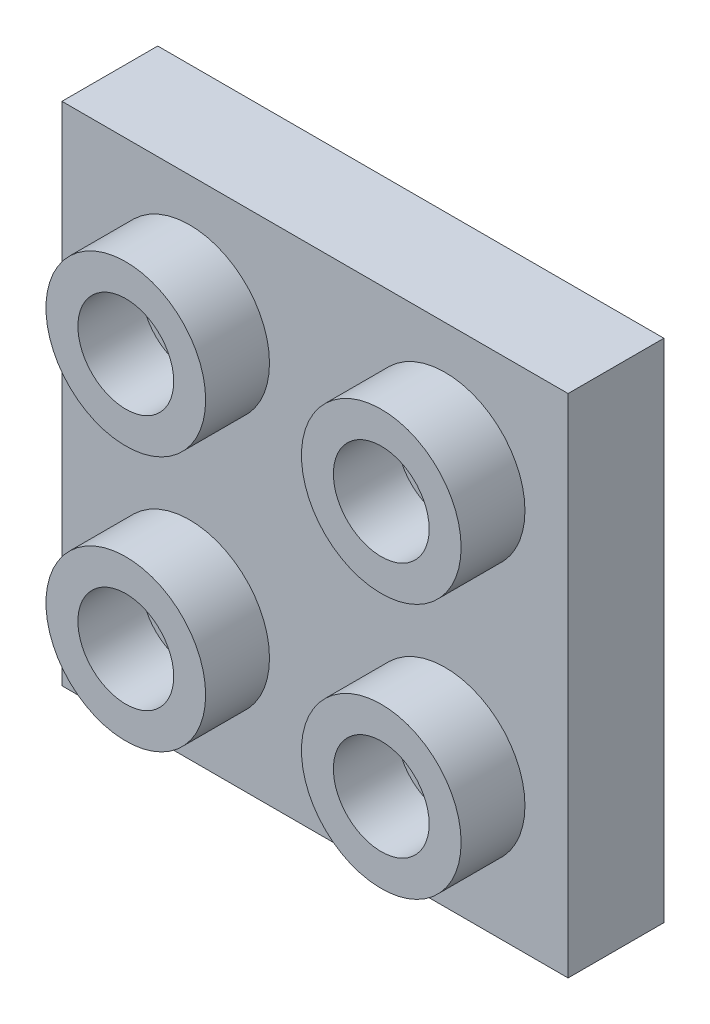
ISO-10303-21;
HEADER;
FILE_DESCRIPTION(('STEP AP214'),'2;1');
FILE_NAME('part.step','',(''),(''),'','','');
FILE_SCHEMA(('AUTOMOTIVE_DESIGN { 1 0 10303 214 1 1 1 1 }'));
ENDSEC;
DATA;
#1=APPLICATION_CONTEXT('core data for automotive mechanical design processes');
#2=APPLICATION_PROTOCOL_DEFINITION('international standard','automotive_design',2000,#1);
#3=PRODUCT_CONTEXT('',#1,'mechanical');
#4=PRODUCT('Part','Part','',(#3));
#5=PRODUCT_RELATED_PRODUCT_CATEGORY('part','',(#4));
#6=PRODUCT_DEFINITION_FORMATION('','',#4);
#7=PRODUCT_DEFINITION_CONTEXT('part definition',#1,'design');
#8=PRODUCT_DEFINITION('design','',#6,#7);
#9=PRODUCT_DEFINITION_SHAPE('','',#8);
#10=(LENGTH_UNIT() NAMED_UNIT(*) SI_UNIT(.MILLI.,.METRE.));
#11=(NAMED_UNIT(*) PLANE_ANGLE_UNIT() SI_UNIT($,.RADIAN.));
#12=(NAMED_UNIT(*) SI_UNIT($,.STERADIAN.) SOLID_ANGLE_UNIT());
#13=UNCERTAINTY_MEASURE_WITH_UNIT(LENGTH_MEASURE(1.E-05),#10,'distance_accuracy_value','');
#14=(GEOMETRIC_REPRESENTATION_CONTEXT(3) GLOBAL_UNCERTAINTY_ASSIGNED_CONTEXT((#13)) GLOBAL_UNIT_ASSIGNED_CONTEXT((#10,
#11,#12)) REPRESENTATION_CONTEXT('',''));
#15=CARTESIAN_POINT('',(0.,0.,0.));
#16=DIRECTION('',(0.,0.,1.));
#17=DIRECTION('',(1.,0.,0.));
#18=AXIS2_PLACEMENT_3D('',#15,#16,#17);
#19=CARTESIAN_POINT('',(-7.07760361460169,-6.48171549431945,-1.));
#20=DIRECTION('',(0.,-1.,0.));
#21=DIRECTION('',(1.,0.,0.));
#22=AXIS2_PLACEMENT_3D('',#19,#20,#21);
#23=PLANE('',#22);
#24=DIRECTION('',(-1.,0.,0.));
#25=VECTOR('',#24,1.);
#26=CARTESIAN_POINT('',(-7.07760361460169,-6.48171549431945,-1.));
#27=LINE('',#26,#25);
#28=CARTESIAN_POINT('',(-4.57760361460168,-6.48171549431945,-1.));
#29=VERTEX_POINT('',#28);
#30=CARTESIAN_POINT('',(-7.07760361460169,-6.48171549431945,-1.));
#31=VERTEX_POINT('',#30);
#32=EDGE_CURVE('E196',#29,#31,#27,.T.);
#33=ORIENTED_EDGE('',*,*,#32,.F.);
#34=DIRECTION('',(0.,0.,-1.));
#35=VECTOR('',#34,1.);
#36=CARTESIAN_POINT('',(-4.57760361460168,-6.48171549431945,-1.));
#37=LINE('',#36,#35);
#38=CARTESIAN_POINT('',(-4.57760361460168,-6.48171549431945,-3.));
#39=VERTEX_POINT('',#38);
#40=EDGE_CURVE('E180',#29,#39,#37,.T.);
#41=ORIENTED_EDGE('',*,*,#40,.T.);
#42=DIRECTION('',(-1.,0.,0.));
#43=VECTOR('',#42,1.);
#44=CARTESIAN_POINT('',(-7.07760361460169,-6.48171549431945,-3.));
#45=LINE('',#44,#43);
#46=CARTESIAN_POINT('',(-7.07760361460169,-6.48171549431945,-3.));
#47=VERTEX_POINT('',#46);
#48=EDGE_CURVE('E208',#39,#47,#45,.T.);
#49=ORIENTED_EDGE('',*,*,#48,.T.);
#50=DIRECTION('',(0.,0.,-1.));
#51=VECTOR('',#50,1.);
#52=CARTESIAN_POINT('',(-7.07760361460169,-6.48171549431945,-1.));
#53=LINE('',#52,#51);
#54=EDGE_CURVE('E211',#31,#47,#53,.T.);
#55=ORIENTED_EDGE('',*,*,#54,.F.);
#56=EDGE_LOOP('',(#33,#41,#49,#55));
#57=FACE_BOUND('',#56,.T.);
#58=ADVANCED_FACE('F39',(#57),#23,.F.);
#59=CARTESIAN_POINT('',(-8.57760361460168,-7.98171549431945,0.));
#60=DIRECTION('',(0.,0.,1.));
#61=DIRECTION('',(1.,0.,0.));
#62=AXIS2_PLACEMENT_3D('',#59,#60,#61);
#63=PLANE('',#62);
#64=CARTESIAN_POINT('',(-4.57760361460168,-3.98171549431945,0.));
#65=DIRECTION('',(0.,0.,1.));
#66=DIRECTION('',(1.,0.,0.));
#67=AXIS2_PLACEMENT_3D('',#64,#65,#66);
#68=CIRCLE('',#67,2.5);
#69=CARTESIAN_POINT('',(-2.07760361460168,-3.98171549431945,0.));
#70=VERTEX_POINT('',#69);
#71=EDGE_CURVE('E224',#70,#70,#68,.T.);
#72=ORIENTED_EDGE('',*,*,#71,.F.);
#73=EDGE_LOOP('',(#72));
#74=FACE_BOUND('',#73,.T.);
#75=DIRECTION('',(1.,0.,0.));
#76=VECTOR('',#75,1.);
#77=CARTESIAN_POINT('',(-8.57760361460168,-7.98171549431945,0.));
#78=LINE('',#77,#76);
#79=CARTESIAN_POINT('',(-8.57760361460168,-7.98171549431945,0.));
#80=VERTEX_POINT('',#79);
#81=CARTESIAN_POINT('',(7.27239638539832,-7.98171549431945,0.));
#82=VERTEX_POINT('',#81);
#83=EDGE_CURVE('E248',#80,#82,#78,.T.);
#84=ORIENTED_EDGE('',*,*,#83,.T.);
#85=DIRECTION('',(0.,1.,0.));
#86=VECTOR('',#85,1.);
#87=CARTESIAN_POINT('',(7.27239638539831,7.86828450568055,0.));
#88=LINE('',#87,#86);
#89=CARTESIAN_POINT('',(7.27239638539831,7.86828450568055,0.));
#90=VERTEX_POINT('',#89);
#91=EDGE_CURVE('E250',#82,#90,#88,.T.);
#92=ORIENTED_EDGE('',*,*,#91,.T.);
#93=DIRECTION('',(-1.,0.,0.));
#94=VECTOR('',#93,1.);
#95=CARTESIAN_POINT('',(-8.57760361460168,7.86828450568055,0.));
#96=LINE('',#95,#94);
#97=CARTESIAN_POINT('',(-8.57760361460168,7.86828450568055,0.));
#98=VERTEX_POINT('',#97);
#99=EDGE_CURVE('E235',#90,#98,#96,.T.);
#100=ORIENTED_EDGE('',*,*,#99,.T.);
#101=DIRECTION('',(0.,-1.,0.));
#102=VECTOR('',#101,1.);
#103=CARTESIAN_POINT('',(-8.57760361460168,7.86828450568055,0.));
#104=LINE('',#103,#102);
#105=EDGE_CURVE('E228',#98,#80,#104,.T.);
#106=ORIENTED_EDGE('',*,*,#105,.T.);
#107=EDGE_LOOP('',(#84,#92,#100,#106));
#108=FACE_BOUND('',#107,.T.);
#109=CARTESIAN_POINT('',(3.42239638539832,-3.98171549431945,0.));
#110=DIRECTION('',(0.,0.,1.));
#111=DIRECTION('',(1.,0.,0.));
#112=AXIS2_PLACEMENT_3D('',#109,#110,#111);
#113=CIRCLE('',#112,2.5);
#114=CARTESIAN_POINT('',(5.92239638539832,-3.98171549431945,0.));
#115=VERTEX_POINT('',#114);
#116=EDGE_CURVE('E213',#115,#115,#113,.T.);
#117=ORIENTED_EDGE('',*,*,#116,.F.);
#118=EDGE_LOOP('',(#117));
#119=FACE_BOUND('',#118,.T.);
#120=CARTESIAN_POINT('',(-4.57760361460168,4.01828450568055,0.));
#121=DIRECTION('',(0.,0.,1.));
#122=DIRECTION('',(1.,0.,0.));
#123=AXIS2_PLACEMENT_3D('',#120,#121,#122);
#124=CIRCLE('',#123,2.5);
#125=CARTESIAN_POINT('',(-2.07760361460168,4.01828450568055,0.));
#126=VERTEX_POINT('',#125);
#127=EDGE_CURVE('E257',#126,#126,#124,.T.);
#128=ORIENTED_EDGE('',*,*,#127,.F.);
#129=EDGE_LOOP('',(#128));
#130=FACE_BOUND('',#129,.T.);
#131=CARTESIAN_POINT('',(3.42239638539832,4.01828450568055,0.));
#132=DIRECTION('',(0.,0.,1.));
#133=DIRECTION('',(1.,0.,0.));
#134=AXIS2_PLACEMENT_3D('',#131,#132,#133);
#135=CIRCLE('',#134,2.5);
#136=CARTESIAN_POINT('',(5.92239638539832,4.01828450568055,0.));
#137=VERTEX_POINT('',#136);
#138=EDGE_CURVE('E269',#137,#137,#135,.T.);
#139=ORIENTED_EDGE('',*,*,#138,.F.);
#140=EDGE_LOOP('',(#139));
#141=FACE_BOUND('',#140,.T.);
#142=ADVANCED_FACE('F319',(#74,#108,#119,#130,#141),#63,.T.);
#143=CARTESIAN_POINT('',(-8.57760361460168,7.86828450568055,-3.));
#144=DIRECTION('',(-1.,0.,0.));
#145=DIRECTION('',(0.,0.,1.));
#146=AXIS2_PLACEMENT_3D('',#143,#144,#145);
#147=PLANE('',#146);
#148=ORIENTED_EDGE('',*,*,#105,.F.);
#149=DIRECTION('',(0.,0.,1.));
#150=VECTOR('',#149,1.);
#151=CARTESIAN_POINT('',(-8.57760361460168,7.86828450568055,-3.));
#152=LINE('',#151,#150);
#153=CARTESIAN_POINT('',(-8.57760361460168,7.86828450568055,-3.));
#154=VERTEX_POINT('',#153);
#155=EDGE_CURVE('E255',#154,#98,#152,.T.);
#156=ORIENTED_EDGE('',*,*,#155,.F.);
#157=DIRECTION('',(0.,-1.,0.));
#158=VECTOR('',#157,1.);
#159=CARTESIAN_POINT('',(-8.57760361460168,7.86828450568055,-3.));
#160=LINE('',#159,#158);
#161=CARTESIAN_POINT('',(-8.57760361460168,-7.98171549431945,-3.));
#162=VERTEX_POINT('',#161);
#163=EDGE_CURVE('E231',#154,#162,#160,.T.);
#164=ORIENTED_EDGE('',*,*,#163,.T.);
#165=DIRECTION('',(0.,0.,1.));
#166=VECTOR('',#165,1.);
#167=CARTESIAN_POINT('',(-8.57760361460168,-7.98171549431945,-3.));
#168=LINE('',#167,#166);
#169=EDGE_CURVE('E245',#162,#80,#168,.T.);
#170=ORIENTED_EDGE('',*,*,#169,.T.);
#171=EDGE_LOOP('',(#148,#156,#164,#170));
#172=FACE_BOUND('',#171,.T.);
#173=ADVANCED_FACE('F310',(#172),#147,.T.);
#174=CARTESIAN_POINT('',(-8.57760361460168,7.86828450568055,-3.));
#175=DIRECTION('',(0.,1.,0.));
#176=DIRECTION('',(0.,0.,1.));
#177=AXIS2_PLACEMENT_3D('',#174,#175,#176);
#178=PLANE('',#177);
#179=ORIENTED_EDGE('',*,*,#99,.F.);
#180=DIRECTION('',(0.,0.,1.));
#181=VECTOR('',#180,1.);
#182=CARTESIAN_POINT('',(7.27239638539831,7.86828450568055,-3.));
#183=LINE('',#182,#181);
#184=CARTESIAN_POINT('',(7.27239638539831,7.86828450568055,-3.));
#185=VERTEX_POINT('',#184);
#186=EDGE_CURVE('E258',#185,#90,#183,.T.);
#187=ORIENTED_EDGE('',*,*,#186,.F.);
#188=DIRECTION('',(-1.,0.,0.));
#189=VECTOR('',#188,1.);
#190=CARTESIAN_POINT('',(-8.57760361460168,7.86828450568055,-3.));
#191=LINE('',#190,#189);
#192=EDGE_CURVE('E242',#185,#154,#191,.T.);
#193=ORIENTED_EDGE('',*,*,#192,.T.);
#194=ORIENTED_EDGE('',*,*,#155,.T.);
#195=EDGE_LOOP('',(#179,#187,#193,#194));
#196=FACE_BOUND('',#195,.T.);
#197=ADVANCED_FACE('F314',(#196),#178,.T.);
#198=CARTESIAN_POINT('',(7.27239638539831,7.86828450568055,-3.));
#199=DIRECTION('',(1.,0.,0.));
#200=DIRECTION('',(0.,1.,0.));
#201=AXIS2_PLACEMENT_3D('',#198,#199,#200);
#202=PLANE('',#201);
#203=ORIENTED_EDGE('',*,*,#91,.F.);
#204=DIRECTION('',(0.,0.,1.));
#205=VECTOR('',#204,1.);
#206=CARTESIAN_POINT('',(7.27239638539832,-7.98171549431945,-3.));
#207=LINE('',#206,#205);
#208=CARTESIAN_POINT('',(7.27239638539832,-7.98171549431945,-3.));
#209=VERTEX_POINT('',#208);
#210=EDGE_CURVE('E260',#209,#82,#207,.T.);
#211=ORIENTED_EDGE('',*,*,#210,.F.);
#212=DIRECTION('',(0.,1.,0.));
#213=VECTOR('',#212,1.);
#214=CARTESIAN_POINT('',(7.27239638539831,7.86828450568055,-3.));
#215=LINE('',#214,#213);
#216=EDGE_CURVE('E239',#209,#185,#215,.T.);
#217=ORIENTED_EDGE('',*,*,#216,.T.);
#218=ORIENTED_EDGE('',*,*,#186,.T.);
#219=EDGE_LOOP('',(#203,#211,#217,#218));
#220=FACE_BOUND('',#219,.T.);
#221=ADVANCED_FACE('F317',(#220),#202,.T.);
#222=CARTESIAN_POINT('',(-8.57760361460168,-7.98171549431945,-3.));
#223=DIRECTION('',(0.,-1.,0.));
#224=DIRECTION('',(0.,0.,-1.));
#225=AXIS2_PLACEMENT_3D('',#222,#223,#224);
#226=PLANE('',#225);
#227=CARTESIAN_POINT('',(-0.577603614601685,-7.98171549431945,-3.5));
#228=DIRECTION('',(0.,-1.,0.));
#229=DIRECTION('',(0.,0.,-1.));
#230=AXIS2_PLACEMENT_3D('',#227,#228,#229);
#231=CIRCLE('',#230,3.);
#232=CARTESIAN_POINT('',(-0.577603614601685,-7.98171549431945,-6.5));
#233=VERTEX_POINT('',#232);
#234=EDGE_CURVE('E788',#233,#233,#231,.T.);
#235=ORIENTED_EDGE('',*,*,#234,.F.);
#236=EDGE_LOOP('',(#235));
#237=FACE_BOUND('',#236,.T.);
#238=ORIENTED_EDGE('',*,*,#210,.T.);
#239=ORIENTED_EDGE('',*,*,#83,.F.);
#240=ORIENTED_EDGE('',*,*,#169,.F.);
#241=DIRECTION('',(1.,0.,0.));
#242=VECTOR('',#241,1.);
#243=CARTESIAN_POINT('',(-8.57760361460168,-7.98171549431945,-3.));
#244=LINE('',#243,#242);
#245=CARTESIAN_POINT('',(-4.57760361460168,-7.98171549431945,-3.));
#246=VERTEX_POINT('',#245);
#247=EDGE_CURVE('E236',#162,#246,#244,.T.);
#248=ORIENTED_EDGE('',*,*,#247,.T.);
#249=DIRECTION('',(0.,0.,-1.));
#250=VECTOR('',#249,1.);
#251=CARTESIAN_POINT('',(-4.57760361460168,-7.98171549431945,-3.5));
#252=LINE('',#251,#250);
#253=CARTESIAN_POINT('',(-4.57760361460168,-7.98171549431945,-3.5));
#254=VERTEX_POINT('',#253);
#255=EDGE_CURVE('E161',#246,#254,#252,.T.);
#256=ORIENTED_EDGE('',*,*,#255,.T.);
#257=CARTESIAN_POINT('',(-0.577603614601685,-7.98171549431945,-3.5));
#258=DIRECTION('',(0.,-1.,0.));
#259=DIRECTION('',(0.,0.,-1.));
#260=AXIS2_PLACEMENT_3D('',#257,#258,#259);
#261=CIRCLE('',#260,4.);
#262=CARTESIAN_POINT('',(3.42239638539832,-7.98171549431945,-3.5));
#263=VERTEX_POINT('',#262);
#264=EDGE_CURVE('E169',#254,#263,#261,.T.);
#265=ORIENTED_EDGE('',*,*,#264,.T.);
#266=DIRECTION('',(0.,0.,1.));
#267=VECTOR('',#266,1.);
#268=CARTESIAN_POINT('',(3.42239638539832,-7.98171549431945,-3.5));
#269=LINE('',#268,#267);
#270=CARTESIAN_POINT('',(3.42239638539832,-7.98171549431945,-3.));
#271=VERTEX_POINT('',#270);
#272=EDGE_CURVE('E146',#263,#271,#269,.T.);
#273=ORIENTED_EDGE('',*,*,#272,.T.);
#274=EDGE_CURVE('E234',#271,#209,#244,.T.);
#275=ORIENTED_EDGE('',*,*,#274,.T.);
#276=EDGE_LOOP('',(#238,#239,#240,#248,#256,#265,#273,#275));
#277=FACE_BOUND('',#276,.T.);
#278=ADVANCED_FACE('F294',(#237,#277),#226,.T.);
#279=CARTESIAN_POINT('',(-8.57760361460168,-7.98171549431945,-3.));
#280=DIRECTION('',(0.,0.,1.));
#281=DIRECTION('',(1.,0.,0.));
#282=AXIS2_PLACEMENT_3D('',#279,#280,#281);
#283=PLANE('',#282);
#284=ORIENTED_EDGE('',*,*,#48,.F.);
#285=DIRECTION('',(0.,-1.,0.));
#286=VECTOR('',#285,1.);
#287=CARTESIAN_POINT('',(-4.57760361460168,-7.98171549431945,-3.));
#288=LINE('',#287,#286);
#289=EDGE_CURVE('E183',#39,#246,#288,.T.);
#290=ORIENTED_EDGE('',*,*,#289,.T.);
#291=ORIENTED_EDGE('',*,*,#247,.F.);
#292=ORIENTED_EDGE('',*,*,#163,.F.);
#293=ORIENTED_EDGE('',*,*,#192,.F.);
#294=ORIENTED_EDGE('',*,*,#216,.F.);
#295=ORIENTED_EDGE('',*,*,#274,.F.);
#296=DIRECTION('',(0.,1.,0.));
#297=VECTOR('',#296,1.);
#298=CARTESIAN_POINT('',(3.42239638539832,-7.98171549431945,-3.));
#299=LINE('',#298,#297);
#300=CARTESIAN_POINT('',(3.42239638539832,-6.48171549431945,-3.));
#301=VERTEX_POINT('',#300);
#302=EDGE_CURVE('E177',#271,#301,#299,.T.);
#303=ORIENTED_EDGE('',*,*,#302,.T.);
#304=CARTESIAN_POINT('',(5.77239638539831,-6.48171549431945,-3.));
#305=VERTEX_POINT('',#304);
#306=EDGE_CURVE('E190',#305,#301,#45,.T.);
#307=ORIENTED_EDGE('',*,*,#306,.F.);
#308=DIRECTION('',(0.,-1.,0.));
#309=VECTOR('',#308,1.);
#310=CARTESIAN_POINT('',(5.77239638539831,-6.48171549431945,-3.));
#311=LINE('',#310,#309);
#312=CARTESIAN_POINT('',(5.77239638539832,6.36828450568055,-3.));
#313=VERTEX_POINT('',#312);
#314=EDGE_CURVE('E205',#313,#305,#311,.T.);
#315=ORIENTED_EDGE('',*,*,#314,.F.);
#316=DIRECTION('',(1.,0.,0.));
#317=VECTOR('',#316,1.);
#318=CARTESIAN_POINT('',(-7.07760361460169,6.36828450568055,-3.));
#319=LINE('',#318,#317);
#320=CARTESIAN_POINT('',(-7.07760361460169,6.36828450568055,-3.));
#321=VERTEX_POINT('',#320);
#322=EDGE_CURVE('E202',#321,#313,#319,.T.);
#323=ORIENTED_EDGE('',*,*,#322,.F.);
#324=DIRECTION('',(0.,1.,0.));
#325=VECTOR('',#324,1.);
#326=CARTESIAN_POINT('',(-7.07760361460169,-6.48171549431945,-3.));
#327=LINE('',#326,#325);
#328=EDGE_CURVE('E61',#47,#321,#327,.T.);
#329=ORIENTED_EDGE('',*,*,#328,.F.);
#330=EDGE_LOOP('',(#284,#290,#291,#292,#293,#294,#295,#303,#307,#315,#323,#329));
#331=FACE_BOUND('',#330,.T.);
#332=ADVANCED_FACE('F290',(#331),#283,.F.);
#333=CARTESIAN_POINT('',(-4.57760361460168,-3.98171549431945,2.));
#334=DIRECTION('',(0.,0.,-1.));
#335=DIRECTION('',(-1.,0.,0.));
#336=AXIS2_PLACEMENT_3D('',#333,#334,#335);
#337=CYLINDRICAL_SURFACE('',#336,2.5);
#338=CARTESIAN_POINT('',(-4.57760361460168,-3.98171549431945,2.));
#339=DIRECTION('',(0.,0.,1.));
#340=DIRECTION('',(1.,0.,0.));
#341=AXIS2_PLACEMENT_3D('',#338,#339,#340);
#342=CIRCLE('',#341,2.5);
#343=CARTESIAN_POINT('',(-2.07760361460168,-3.98171549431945,2.));
#344=VERTEX_POINT('',#343);
#345=EDGE_CURVE('E225',#344,#344,#342,.T.);
#346=ORIENTED_EDGE('',*,*,#345,.F.);
#347=EDGE_LOOP('',(#346));
#348=FACE_BOUND('',#347,.T.);
#349=ORIENTED_EDGE('',*,*,#71,.T.);
#350=EDGE_LOOP('',(#349));
#351=FACE_BOUND('',#350,.T.);
#352=ADVANCED_FACE('F369',(#348,#351),#337,.T.);
#353=CARTESIAN_POINT('',(-4.57760361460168,-3.98171549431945,2.));
#354=DIRECTION('',(0.,0.,1.));
#355=DIRECTION('',(1.,0.,0.));
#356=AXIS2_PLACEMENT_3D('',#353,#354,#355);
#357=PLANE('',#356);
#358=CARTESIAN_POINT('',(-4.57760361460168,-3.98171549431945,2.));
#359=DIRECTION('',(0.,0.,1.));
#360=DIRECTION('',(1.,0.,0.));
#361=AXIS2_PLACEMENT_3D('',#358,#359,#360);
#362=CIRCLE('',#361,1.5);
#363=CARTESIAN_POINT('',(-3.07760361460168,-3.98171549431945,2.));
#364=VERTEX_POINT('',#363);
#365=EDGE_CURVE('E165',#364,#364,#362,.T.);
#366=ORIENTED_EDGE('',*,*,#365,.F.);
#367=EDGE_LOOP('',(#366));
#368=FACE_BOUND('',#367,.T.);
#369=ORIENTED_EDGE('',*,*,#345,.T.);
#370=EDGE_LOOP('',(#369));
#371=FACE_BOUND('',#370,.T.);
#372=ADVANCED_FACE('F363',(#368,#371),#357,.T.);
#373=CARTESIAN_POINT('',(3.42239638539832,-3.98171549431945,2.));
#374=DIRECTION('',(0.,0.,-1.));
#375=DIRECTION('',(-1.,0.,0.));
#376=AXIS2_PLACEMENT_3D('',#373,#374,#375);
#377=CYLINDRICAL_SURFACE('',#376,2.5);
#378=CARTESIAN_POINT('',(3.42239638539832,-3.98171549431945,2.));
#379=DIRECTION('',(0.,0.,1.));
#380=DIRECTION('',(1.,0.,0.));
#381=AXIS2_PLACEMENT_3D('',#378,#379,#380);
#382=CIRCLE('',#381,2.5);
#383=CARTESIAN_POINT('',(5.92239638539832,-3.98171549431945,2.));
#384=VERTEX_POINT('',#383);
#385=EDGE_CURVE('E221',#384,#384,#382,.T.);
#386=ORIENTED_EDGE('',*,*,#385,.F.);
#387=EDGE_LOOP('',(#386));
#388=FACE_BOUND('',#387,.T.);
#389=ORIENTED_EDGE('',*,*,#116,.T.);
#390=EDGE_LOOP('',(#389));
#391=FACE_BOUND('',#390,.T.);
#392=ADVANCED_FACE('F361',(#388,#391),#377,.T.);
#393=CARTESIAN_POINT('',(3.42239638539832,-3.98171549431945,2.));
#394=DIRECTION('',(0.,0.,1.));
#395=DIRECTION('',(1.,0.,0.));
#396=AXIS2_PLACEMENT_3D('',#393,#394,#395);
#397=PLANE('',#396);
#398=CARTESIAN_POINT('',(3.42239638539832,-3.98171549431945,2.));
#399=DIRECTION('',(0.,0.,1.));
#400=DIRECTION('',(1.,0.,0.));
#401=AXIS2_PLACEMENT_3D('',#398,#399,#400);
#402=CIRCLE('',#401,1.5);
#403=CARTESIAN_POINT('',(4.92239638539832,-3.98171549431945,2.));
#404=VERTEX_POINT('',#403);
#405=EDGE_CURVE('E402',#404,#404,#402,.T.);
#406=ORIENTED_EDGE('',*,*,#405,.F.);
#407=EDGE_LOOP('',(#406));
#408=FACE_BOUND('',#407,.T.);
#409=ORIENTED_EDGE('',*,*,#385,.T.);
#410=EDGE_LOOP('',(#409));
#411=FACE_BOUND('',#410,.T.);
#412=ADVANCED_FACE('F357',(#408,#411),#397,.T.);
#413=CARTESIAN_POINT('',(-4.57760361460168,4.01828450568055,2.));
#414=DIRECTION('',(0.,0.,1.));
#415=DIRECTION('',(1.,0.,0.));
#416=AXIS2_PLACEMENT_3D('',#413,#414,#415);
#417=PLANE('',#416);
#418=CARTESIAN_POINT('',(-4.57760361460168,4.01828450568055,2.));
#419=DIRECTION('',(0.,0.,1.));
#420=DIRECTION('',(1.,0.,0.));
#421=AXIS2_PLACEMENT_3D('',#418,#419,#420);
#422=CIRCLE('',#421,1.5);
#423=CARTESIAN_POINT('',(-3.07760361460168,4.01828450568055,2.));
#424=VERTEX_POINT('',#423);
#425=EDGE_CURVE('E394',#424,#424,#422,.T.);
#426=ORIENTED_EDGE('',*,*,#425,.F.);
#427=EDGE_LOOP('',(#426));
#428=FACE_BOUND('',#427,.T.);
#429=CARTESIAN_POINT('',(-4.57760361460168,4.01828450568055,2.));
#430=DIRECTION('',(0.,0.,1.));
#431=DIRECTION('',(1.,0.,0.));
#432=AXIS2_PLACEMENT_3D('',#429,#430,#431);
#433=CIRCLE('',#432,2.5);
#434=CARTESIAN_POINT('',(-2.07760361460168,4.01828450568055,2.));
#435=VERTEX_POINT('',#434);
#436=EDGE_CURVE('E266',#435,#435,#433,.T.);
#437=ORIENTED_EDGE('',*,*,#436,.T.);
#438=EDGE_LOOP('',(#437));
#439=FACE_BOUND('',#438,.T.);
#440=ADVANCED_FACE('F360',(#428,#439),#417,.T.);
#441=CARTESIAN_POINT('',(-4.57760361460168,4.01828450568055,2.));
#442=DIRECTION('',(0.,0.,-1.));
#443=DIRECTION('',(-1.,0.,0.));
#444=AXIS2_PLACEMENT_3D('',#441,#442,#443);
#445=CYLINDRICAL_SURFACE('',#444,2.5);
#446=ORIENTED_EDGE('',*,*,#436,.F.);
#447=EDGE_LOOP('',(#446));
#448=FACE_BOUND('',#447,.T.);
#449=ORIENTED_EDGE('',*,*,#127,.T.);
#450=EDGE_LOOP('',(#449));
#451=FACE_BOUND('',#450,.T.);
#452=ADVANCED_FACE('F338',(#448,#451),#445,.T.);
#453=CARTESIAN_POINT('',(3.42239638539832,4.01828450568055,2.));
#454=DIRECTION('',(0.,0.,1.));
#455=DIRECTION('',(1.,0.,0.));
#456=AXIS2_PLACEMENT_3D('',#453,#454,#455);
#457=PLANE('',#456);
#458=CARTESIAN_POINT('',(3.42239638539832,4.01828450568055,2.));
#459=DIRECTION('',(0.,0.,1.));
#460=DIRECTION('',(1.,0.,0.));
#461=AXIS2_PLACEMENT_3D('',#458,#459,#460);
#462=CIRCLE('',#461,1.5);
#463=CARTESIAN_POINT('',(4.92239638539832,4.01828450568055,2.));
#464=VERTEX_POINT('',#463);
#465=EDGE_CURVE('E405',#464,#464,#462,.T.);
#466=ORIENTED_EDGE('',*,*,#465,.F.);
#467=EDGE_LOOP('',(#466));
#468=FACE_BOUND('',#467,.T.);
#469=CARTESIAN_POINT('',(3.42239638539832,4.01828450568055,2.));
#470=DIRECTION('',(0.,0.,1.));
#471=DIRECTION('',(1.,0.,0.));
#472=AXIS2_PLACEMENT_3D('',#469,#470,#471);
#473=CIRCLE('',#472,2.5);
#474=CARTESIAN_POINT('',(5.92239638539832,4.01828450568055,2.));
#475=VERTEX_POINT('',#474);
#476=EDGE_CURVE('E272',#475,#475,#473,.T.);
#477=ORIENTED_EDGE('',*,*,#476,.T.);
#478=EDGE_LOOP('',(#477));
#479=FACE_BOUND('',#478,.T.);
#480=ADVANCED_FACE('F41',(#468,#479),#457,.T.);
#481=CARTESIAN_POINT('',(3.42239638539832,4.01828450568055,2.));
#482=DIRECTION('',(0.,0.,-1.));
#483=DIRECTION('',(-1.,0.,0.));
#484=AXIS2_PLACEMENT_3D('',#481,#482,#483);
#485=CYLINDRICAL_SURFACE('',#484,2.5);
#486=ORIENTED_EDGE('',*,*,#476,.F.);
#487=EDGE_LOOP('',(#486));
#488=FACE_BOUND('',#487,.T.);
#489=ORIENTED_EDGE('',*,*,#138,.T.);
#490=EDGE_LOOP('',(#489));
#491=FACE_BOUND('',#490,.T.);
#492=ADVANCED_FACE('F330',(#488,#491),#485,.T.);
#493=CARTESIAN_POINT('',(-7.07760361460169,-6.48171549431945,-1.));
#494=DIRECTION('',(-1.,0.,0.));
#495=DIRECTION('',(0.,0.,1.));
#496=AXIS2_PLACEMENT_3D('',#493,#494,#495);
#497=PLANE('',#496);
#498=ORIENTED_EDGE('',*,*,#328,.T.);
#499=DIRECTION('',(0.,0.,-1.));
#500=VECTOR('',#499,1.);
#501=CARTESIAN_POINT('',(-7.07760361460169,6.36828450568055,-1.));
#502=LINE('',#501,#500);
#503=CARTESIAN_POINT('',(-7.07760361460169,6.36828450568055,-1.));
#504=VERTEX_POINT('',#503);
#505=EDGE_CURVE('E200',#504,#321,#502,.T.);
#506=ORIENTED_EDGE('',*,*,#505,.F.);
#507=DIRECTION('',(0.,1.,0.));
#508=VECTOR('',#507,1.);
#509=CARTESIAN_POINT('',(-7.07760361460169,-6.48171549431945,-1.));
#510=LINE('',#509,#508);
#511=EDGE_CURVE('E186',#31,#504,#510,.T.);
#512=ORIENTED_EDGE('',*,*,#511,.F.);
#513=ORIENTED_EDGE('',*,*,#54,.T.);
#514=EDGE_LOOP('',(#498,#506,#512,#513));
#515=FACE_BOUND('',#514,.T.);
#516=ADVANCED_FACE('F303',(#515),#497,.F.);
#517=ORIENTED_EDGE('',*,*,#306,.T.);
#518=DIRECTION('',(0.,0.,1.));
#519=VECTOR('',#518,1.);
#520=CARTESIAN_POINT('',(3.42239638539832,-6.48171549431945,-1.));
#521=LINE('',#520,#519);
#522=CARTESIAN_POINT('',(3.42239638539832,-6.48171549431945,-1.));
#523=VERTEX_POINT('',#522);
#524=EDGE_CURVE('E173',#301,#523,#521,.T.);
#525=ORIENTED_EDGE('',*,*,#524,.T.);
#526=CARTESIAN_POINT('',(5.77239638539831,-6.48171549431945,-1.));
#527=VERTEX_POINT('',#526);
#528=EDGE_CURVE('E197',#527,#523,#27,.T.);
#529=ORIENTED_EDGE('',*,*,#528,.F.);
#530=DIRECTION('',(0.,0.,-1.));
#531=VECTOR('',#530,1.);
#532=CARTESIAN_POINT('',(5.77239638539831,-6.48171549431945,-1.));
#533=LINE('',#532,#531);
#534=EDGE_CURVE('E214',#527,#305,#533,.T.);
#535=ORIENTED_EDGE('',*,*,#534,.T.);
#536=EDGE_LOOP('',(#517,#525,#529,#535));
#537=FACE_BOUND('',#536,.T.);
#538=ADVANCED_FACE('F278',(#537),#23,.F.);
#539=CARTESIAN_POINT('',(5.77239638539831,-6.48171549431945,-1.));
#540=DIRECTION('',(1.,0.,0.));
#541=DIRECTION('',(0.,1.,0.));
#542=AXIS2_PLACEMENT_3D('',#539,#540,#541);
#543=PLANE('',#542);
#544=ORIENTED_EDGE('',*,*,#314,.T.);
#545=ORIENTED_EDGE('',*,*,#534,.F.);
#546=DIRECTION('',(0.,-1.,0.));
#547=VECTOR('',#546,1.);
#548=CARTESIAN_POINT('',(5.77239638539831,-6.48171549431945,-1.));
#549=LINE('',#548,#547);
#550=CARTESIAN_POINT('',(5.77239638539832,6.36828450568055,-1.));
#551=VERTEX_POINT('',#550);
#552=EDGE_CURVE('E193',#551,#527,#549,.T.);
#553=ORIENTED_EDGE('',*,*,#552,.F.);
#554=DIRECTION('',(0.,0.,-1.));
#555=VECTOR('',#554,1.);
#556=CARTESIAN_POINT('',(5.77239638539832,6.36828450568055,-1.));
#557=LINE('',#556,#555);
#558=EDGE_CURVE('E216',#551,#313,#557,.T.);
#559=ORIENTED_EDGE('',*,*,#558,.T.);
#560=EDGE_LOOP('',(#544,#545,#553,#559));
#561=FACE_BOUND('',#560,.T.);
#562=ADVANCED_FACE('F285',(#561),#543,.F.);
#563=CARTESIAN_POINT('',(-7.07760361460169,6.36828450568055,-1.));
#564=DIRECTION('',(0.,1.,0.));
#565=DIRECTION('',(-1.,0.,0.));
#566=AXIS2_PLACEMENT_3D('',#563,#564,#565);
#567=PLANE('',#566);
#568=ORIENTED_EDGE('',*,*,#322,.T.);
#569=ORIENTED_EDGE('',*,*,#558,.F.);
#570=DIRECTION('',(1.,0.,0.));
#571=VECTOR('',#570,1.);
#572=CARTESIAN_POINT('',(-7.07760361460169,6.36828450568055,-1.));
#573=LINE('',#572,#571);
#574=EDGE_CURVE('E189',#504,#551,#573,.T.);
#575=ORIENTED_EDGE('',*,*,#574,.F.);
#576=ORIENTED_EDGE('',*,*,#505,.T.);
#577=EDGE_LOOP('',(#568,#569,#575,#576));
#578=FACE_BOUND('',#577,.T.);
#579=ADVANCED_FACE('F305',(#578),#567,.F.);
#580=CARTESIAN_POINT('',(-7.07760361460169,6.36828450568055,-1.));
#581=DIRECTION('',(0.,0.,-1.));
#582=DIRECTION('',(-1.,0.,0.));
#583=AXIS2_PLACEMENT_3D('',#580,#581,#582);
#584=PLANE('',#583);
#585=DIRECTION('',(0.,1.,0.));
#586=VECTOR('',#585,1.);
#587=CARTESIAN_POINT('',(-4.57760361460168,6.36828450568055,-1.));
#588=LINE('',#587,#586);
#589=CARTESIAN_POINT('',(-4.57760361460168,-0.98171549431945,-1.));
#590=VERTEX_POINT('',#589);
#591=EDGE_CURVE('E11',#29,#590,#588,.T.);
#592=ORIENTED_EDGE('',*,*,#591,.F.);
#593=ORIENTED_EDGE('',*,*,#32,.T.);
#594=ORIENTED_EDGE('',*,*,#511,.T.);
#595=ORIENTED_EDGE('',*,*,#574,.T.);
#596=ORIENTED_EDGE('',*,*,#552,.T.);
#597=ORIENTED_EDGE('',*,*,#528,.T.);
#598=DIRECTION('',(0.,-1.,0.));
#599=VECTOR('',#598,1.);
#600=CARTESIAN_POINT('',(3.42239638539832,6.36828450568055,-1.));
#601=LINE('',#600,#599);
#602=CARTESIAN_POINT('',(3.42239638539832,-0.98171549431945,-1.));
#603=VERTEX_POINT('',#602);
#604=EDGE_CURVE('E47',#603,#523,#601,.T.);
#605=ORIENTED_EDGE('',*,*,#604,.F.);
#606=DIRECTION('',(-1.,0.,0.));
#607=VECTOR('',#606,1.);
#608=CARTESIAN_POINT('',(-7.07760361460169,-0.98171549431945,-1.));
#609=LINE('',#608,#607);
#610=EDGE_CURVE('E156',#603,#590,#609,.T.);
#611=ORIENTED_EDGE('',*,*,#610,.T.);
#612=EDGE_LOOP('',(#592,#593,#594,#595,#596,#597,#605,#611));
#613=FACE_BOUND('',#612,.T.);
#614=ADVANCED_FACE('F281',(#613),#584,.T.);
#615=CARTESIAN_POINT('',(-4.57760361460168,-0.98171549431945,-3.5));
#616=DIRECTION('',(-1.,0.,0.));
#617=DIRECTION('',(0.,0.,1.));
#618=AXIS2_PLACEMENT_3D('',#615,#616,#617);
#619=PLANE('',#618);
#620=ORIENTED_EDGE('',*,*,#289,.F.);
#621=ORIENTED_EDGE('',*,*,#40,.F.);
#622=ORIENTED_EDGE('',*,*,#591,.T.);
#623=DIRECTION('',(0.,0.,-1.));
#624=VECTOR('',#623,1.);
#625=CARTESIAN_POINT('',(-4.57760361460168,-0.98171549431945,-3.5));
#626=LINE('',#625,#624);
#627=CARTESIAN_POINT('',(-4.57760361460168,-0.98171549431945,-3.5));
#628=VERTEX_POINT('',#627);
#629=EDGE_CURVE('E54',#590,#628,#626,.T.);
#630=ORIENTED_EDGE('',*,*,#629,.T.);
#631=DIRECTION('',(0.,-1.,0.));
#632=VECTOR('',#631,1.);
#633=CARTESIAN_POINT('',(-4.57760361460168,-0.98171549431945,-3.5));
#634=LINE('',#633,#632);
#635=EDGE_CURVE('E151',#628,#254,#634,.T.);
#636=ORIENTED_EDGE('',*,*,#635,.T.);
#637=ORIENTED_EDGE('',*,*,#255,.F.);
#638=EDGE_LOOP('',(#620,#621,#622,#630,#636,#637));
#639=FACE_BOUND('',#638,.T.);
#640=ADVANCED_FACE('F298',(#639),#619,.T.);
#641=CARTESIAN_POINT('',(3.42239638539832,-0.98171549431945,-3.5));
#642=DIRECTION('',(1.,0.,0.));
#643=DIRECTION('',(0.,0.,-1.));
#644=AXIS2_PLACEMENT_3D('',#641,#642,#643);
#645=PLANE('',#644);
#646=ORIENTED_EDGE('',*,*,#302,.F.);
#647=ORIENTED_EDGE('',*,*,#272,.F.);
#648=DIRECTION('',(0.,-1.,0.));
#649=VECTOR('',#648,1.);
#650=CARTESIAN_POINT('',(3.42239638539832,-0.98171549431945,-3.5));
#651=LINE('',#650,#649);
#652=CARTESIAN_POINT('',(3.42239638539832,-0.98171549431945,-3.5));
#653=VERTEX_POINT('',#652);
#654=EDGE_CURVE('E140',#653,#263,#651,.T.);
#655=ORIENTED_EDGE('',*,*,#654,.F.);
#656=DIRECTION('',(0.,0.,1.));
#657=VECTOR('',#656,1.);
#658=CARTESIAN_POINT('',(3.42239638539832,-0.98171549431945,-3.5));
#659=LINE('',#658,#657);
#660=EDGE_CURVE('E143',#653,#603,#659,.T.);
#661=ORIENTED_EDGE('',*,*,#660,.T.);
#662=ORIENTED_EDGE('',*,*,#604,.T.);
#663=ORIENTED_EDGE('',*,*,#524,.F.);
#664=EDGE_LOOP('',(#646,#647,#655,#661,#662,#663));
#665=FACE_BOUND('',#664,.T.);
#666=ADVANCED_FACE('F142',(#665),#645,.T.);
#667=CARTESIAN_POINT('',(-0.577603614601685,-0.98171549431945,-3.5));
#668=DIRECTION('',(0.,-1.,0.));
#669=DIRECTION('',(0.,0.,-1.));
#670=AXIS2_PLACEMENT_3D('',#667,#668,#669);
#671=CYLINDRICAL_SURFACE('',#670,4.);
#672=ORIENTED_EDGE('',*,*,#264,.F.);
#673=ORIENTED_EDGE('',*,*,#635,.F.);
#674=CARTESIAN_POINT('',(-0.577603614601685,-0.98171549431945,-3.5));
#675=DIRECTION('',(0.,-1.,0.));
#676=DIRECTION('',(0.,0.,-1.));
#677=AXIS2_PLACEMENT_3D('',#674,#675,#676);
#678=CIRCLE('',#677,4.);
#679=EDGE_CURVE('E154',#628,#653,#678,.T.);
#680=ORIENTED_EDGE('',*,*,#679,.T.);
#681=ORIENTED_EDGE('',*,*,#654,.T.);
#682=EDGE_LOOP('',(#672,#673,#680,#681));
#683=FACE_BOUND('',#682,.T.);
#684=ADVANCED_FACE('F159',(#683),#671,.T.);
#685=CARTESIAN_POINT('',(-0.577603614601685,-0.98171549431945,-3.5));
#686=DIRECTION('',(0.,-1.,0.));
#687=DIRECTION('',(0.,0.,-1.));
#688=AXIS2_PLACEMENT_3D('',#685,#686,#687);
#689=PLANE('',#688);
#690=CARTESIAN_POINT('',(-0.577603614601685,-0.98171549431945,-3.5));
#691=DIRECTION('',(0.,-1.,0.));
#692=DIRECTION('',(0.,0.,-1.));
#693=AXIS2_PLACEMENT_3D('',#690,#691,#692);
#694=CIRCLE('',#693,2.4);
#695=CARTESIAN_POINT('',(-0.577603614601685,-0.98171549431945,-5.9));
#696=VERTEX_POINT('',#695);
#697=EDGE_CURVE('E787',#696,#696,#694,.T.);
#698=ORIENTED_EDGE('',*,*,#697,.T.);
#699=EDGE_LOOP('',(#698));
#700=FACE_BOUND('',#699,.T.);
#701=ORIENTED_EDGE('',*,*,#610,.F.);
#702=ORIENTED_EDGE('',*,*,#660,.F.);
#703=ORIENTED_EDGE('',*,*,#679,.F.);
#704=ORIENTED_EDGE('',*,*,#629,.F.);
#705=EDGE_LOOP('',(#701,#702,#703,#704));
#706=FACE_BOUND('',#705,.T.);
#707=ADVANCED_FACE('F153',(#700,#706),#689,.F.);
#708=CARTESIAN_POINT('',(-4.57760361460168,-3.98171549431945,0.));
#709=DIRECTION('',(0.,0.,1.));
#710=DIRECTION('',(1.,0.,0.));
#711=AXIS2_PLACEMENT_3D('',#708,#709,#710);
#712=CYLINDRICAL_SURFACE('',#711,1.5);
#713=CARTESIAN_POINT('',(-4.57760361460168,-3.98171549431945,0.));
#714=DIRECTION('',(0.,0.,1.));
#715=DIRECTION('',(1.,0.,0.));
#716=AXIS2_PLACEMENT_3D('',#713,#714,#715);
#717=CIRCLE('',#716,1.5);
#718=CARTESIAN_POINT('',(-3.07760361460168,-3.98171549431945,0.));
#719=VERTEX_POINT('',#718);
#720=EDGE_CURVE('E171',#719,#719,#717,.T.);
#721=ORIENTED_EDGE('',*,*,#720,.F.);
#722=EDGE_LOOP('',(#721));
#723=FACE_BOUND('',#722,.T.);
#724=ORIENTED_EDGE('',*,*,#365,.T.);
#725=EDGE_LOOP('',(#724));
#726=FACE_BOUND('',#725,.T.);
#727=ADVANCED_FACE('F419',(#723,#726),#712,.F.);
#728=CARTESIAN_POINT('',(-4.57760361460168,-3.98171549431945,0.));
#729=DIRECTION('',(0.,0.,1.));
#730=DIRECTION('',(1.,0.,0.));
#731=AXIS2_PLACEMENT_3D('',#728,#729,#730);
#732=PLANE('',#731);
#733=ORIENTED_EDGE('',*,*,#720,.T.);
#734=EDGE_LOOP('',(#733));
#735=FACE_BOUND('',#734,.T.);
#736=ADVANCED_FACE('F425',(#735),#732,.T.);
#737=CARTESIAN_POINT('',(3.42239638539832,-3.98171549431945,0.));
#738=DIRECTION('',(0.,0.,1.));
#739=DIRECTION('',(1.,0.,0.));
#740=AXIS2_PLACEMENT_3D('',#737,#738,#739);
#741=CYLINDRICAL_SURFACE('',#740,1.5);
#742=CARTESIAN_POINT('',(3.42239638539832,-3.98171549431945,0.));
#743=DIRECTION('',(0.,0.,1.));
#744=DIRECTION('',(1.,0.,0.));
#745=AXIS2_PLACEMENT_3D('',#742,#743,#744);
#746=CIRCLE('',#745,1.5);
#747=CARTESIAN_POINT('',(4.92239638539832,-3.98171549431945,0.));
#748=VERTEX_POINT('',#747);
#749=EDGE_CURVE('E409',#748,#748,#746,.T.);
#750=ORIENTED_EDGE('',*,*,#749,.F.);
#751=EDGE_LOOP('',(#750));
#752=FACE_BOUND('',#751,.T.);
#753=ORIENTED_EDGE('',*,*,#405,.T.);
#754=EDGE_LOOP('',(#753));
#755=FACE_BOUND('',#754,.T.);
#756=ADVANCED_FACE('F432',(#752,#755),#741,.F.);
#757=CARTESIAN_POINT('',(3.42239638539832,-3.98171549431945,0.));
#758=DIRECTION('',(0.,0.,1.));
#759=DIRECTION('',(1.,0.,0.));
#760=AXIS2_PLACEMENT_3D('',#757,#758,#759);
#761=PLANE('',#760);
#762=ORIENTED_EDGE('',*,*,#749,.T.);
#763=EDGE_LOOP('',(#762));
#764=FACE_BOUND('',#763,.T.);
#765=ADVANCED_FACE('F473',(#764),#761,.T.);
#766=CARTESIAN_POINT('',(-4.57760361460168,4.01828450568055,0.));
#767=DIRECTION('',(0.,0.,1.));
#768=DIRECTION('',(1.,0.,0.));
#769=AXIS2_PLACEMENT_3D('',#766,#767,#768);
#770=CYLINDRICAL_SURFACE('',#769,1.5);
#771=CARTESIAN_POINT('',(-4.57760361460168,4.01828450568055,0.));
#772=DIRECTION('',(0.,0.,1.));
#773=DIRECTION('',(1.,0.,0.));
#774=AXIS2_PLACEMENT_3D('',#771,#772,#773);
#775=CIRCLE('',#774,1.5);
#776=CARTESIAN_POINT('',(-3.07760361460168,4.01828450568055,0.));
#777=VERTEX_POINT('',#776);
#778=EDGE_CURVE('E398',#777,#777,#775,.T.);
#779=ORIENTED_EDGE('',*,*,#778,.F.);
#780=EDGE_LOOP('',(#779));
#781=FACE_BOUND('',#780,.T.);
#782=ORIENTED_EDGE('',*,*,#425,.T.);
#783=EDGE_LOOP('',(#782));
#784=FACE_BOUND('',#783,.T.);
#785=ADVANCED_FACE('F479',(#781,#784),#770,.F.);
#786=CARTESIAN_POINT('',(-4.57760361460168,4.01828450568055,0.));
#787=DIRECTION('',(0.,0.,1.));
#788=DIRECTION('',(1.,0.,0.));
#789=AXIS2_PLACEMENT_3D('',#786,#787,#788);
#790=PLANE('',#789);
#791=ORIENTED_EDGE('',*,*,#778,.T.);
#792=EDGE_LOOP('',(#791));
#793=FACE_BOUND('',#792,.T.);
#794=ADVANCED_FACE('F482',(#793),#790,.T.);
#795=CARTESIAN_POINT('',(3.42239638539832,4.01828450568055,0.));
#796=DIRECTION('',(0.,0.,1.));
#797=DIRECTION('',(1.,0.,0.));
#798=AXIS2_PLACEMENT_3D('',#795,#796,#797);
#799=CYLINDRICAL_SURFACE('',#798,1.5);
#800=CARTESIAN_POINT('',(3.42239638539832,4.01828450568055,0.));
#801=DIRECTION('',(0.,0.,1.));
#802=DIRECTION('',(1.,0.,0.));
#803=AXIS2_PLACEMENT_3D('',#800,#801,#802);
#804=CIRCLE('',#803,1.5);
#805=CARTESIAN_POINT('',(4.92239638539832,4.01828450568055,0.));
#806=VERTEX_POINT('',#805);
#807=EDGE_CURVE('E399',#806,#806,#804,.T.);
#808=ORIENTED_EDGE('',*,*,#807,.F.);
#809=EDGE_LOOP('',(#808));
#810=FACE_BOUND('',#809,.T.);
#811=ORIENTED_EDGE('',*,*,#465,.T.);
#812=EDGE_LOOP('',(#811));
#813=FACE_BOUND('',#812,.T.);
#814=ADVANCED_FACE('F489',(#810,#813),#799,.F.);
#815=CARTESIAN_POINT('',(3.42239638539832,4.01828450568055,0.));
#816=DIRECTION('',(0.,0.,1.));
#817=DIRECTION('',(1.,0.,0.));
#818=AXIS2_PLACEMENT_3D('',#815,#816,#817);
#819=PLANE('',#818);
#820=ORIENTED_EDGE('',*,*,#807,.T.);
#821=EDGE_LOOP('',(#820));
#822=FACE_BOUND('',#821,.T.);
#823=ADVANCED_FACE('F491',(#822),#819,.T.);
#824=CARTESIAN_POINT('',(-0.577603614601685,-7.28171549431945,-3.5));
#825=DIRECTION('',(0.,-1.,0.));
#826=DIRECTION('',(0.,0.,-1.));
#827=AXIS2_PLACEMENT_3D('',#824,#825,#826);
#828=CYLINDRICAL_SURFACE('',#827,3.);
#829=CARTESIAN_POINT('',(-0.577603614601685,-7.28171549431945,-3.5));
#830=DIRECTION('',(0.,-1.,0.));
#831=DIRECTION('',(0.,0.,-1.));
#832=AXIS2_PLACEMENT_3D('',#829,#830,#831);
#833=CIRCLE('',#832,3.);
#834=CARTESIAN_POINT('',(-0.577603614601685,-7.28171549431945,-6.5));
#835=VERTEX_POINT('',#834);
#836=EDGE_CURVE('E791',#835,#835,#833,.T.);
#837=ORIENTED_EDGE('',*,*,#836,.F.);
#838=EDGE_LOOP('',(#837));
#839=FACE_BOUND('',#838,.T.);
#840=ORIENTED_EDGE('',*,*,#234,.T.);
#841=EDGE_LOOP('',(#840));
#842=FACE_BOUND('',#841,.T.);
#843=ADVANCED_FACE('F503',(#839,#842),#828,.F.);
#844=CARTESIAN_POINT('',(-0.577603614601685,-7.28171549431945,-3.5));
#845=DIRECTION('',(0.,-1.,0.));
#846=DIRECTION('',(0.,0.,-1.));
#847=AXIS2_PLACEMENT_3D('',#844,#845,#846);
#848=PLANE('',#847);
#849=CARTESIAN_POINT('',(-0.577603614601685,-7.28171549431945,-3.5));
#850=DIRECTION('',(0.,-1.,0.));
#851=DIRECTION('',(0.,0.,-1.));
#852=AXIS2_PLACEMENT_3D('',#849,#850,#851);
#853=CIRCLE('',#852,2.4);
#854=CARTESIAN_POINT('',(-0.577603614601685,-7.28171549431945,-5.9));
#855=VERTEX_POINT('',#854);
#856=EDGE_CURVE('E784',#855,#855,#853,.T.);
#857=ORIENTED_EDGE('',*,*,#856,.F.);
#858=EDGE_LOOP('',(#857));
#859=FACE_BOUND('',#858,.T.);
#860=ORIENTED_EDGE('',*,*,#836,.T.);
#861=EDGE_LOOP('',(#860));
#862=FACE_BOUND('',#861,.T.);
#863=ADVANCED_FACE('F512',(#859,#862),#848,.T.);
#864=CARTESIAN_POINT('',(-0.577603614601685,1.41828450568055,-3.5));
#865=DIRECTION('',(0.,-1.,0.));
#866=DIRECTION('',(0.,0.,-1.));
#867=AXIS2_PLACEMENT_3D('',#864,#865,#866);
#868=CYLINDRICAL_SURFACE('',#867,2.4);
#869=ORIENTED_EDGE('',*,*,#856,.T.);
#870=EDGE_LOOP('',(#869));
#871=FACE_BOUND('',#870,.T.);
#872=ORIENTED_EDGE('',*,*,#697,.F.);
#873=EDGE_LOOP('',(#872));
#874=FACE_BOUND('',#873,.T.);
#875=ADVANCED_FACE('F520',(#871,#874),#868,.F.);
#876=CLOSED_SHELL('',(#58,#142,#173,#197,#221,#278,#332,#352,#372,#392,#412,#440,#452,#480,#492,
#516,#538,#562,#579,#614,#640,#666,#684,#707,#727,#736,#756,#765,#785,#794,#814,#823,#843,#863,#875));
#877=MANIFOLD_SOLID_BREP('B2',#876);
#878=ADVANCED_BREP_SHAPE_REPRESENTATION('',(#18,#877),#14);
#879=SHAPE_DEFINITION_REPRESENTATION(#9,#878);
ENDSEC;
END-ISO-10303-21;
